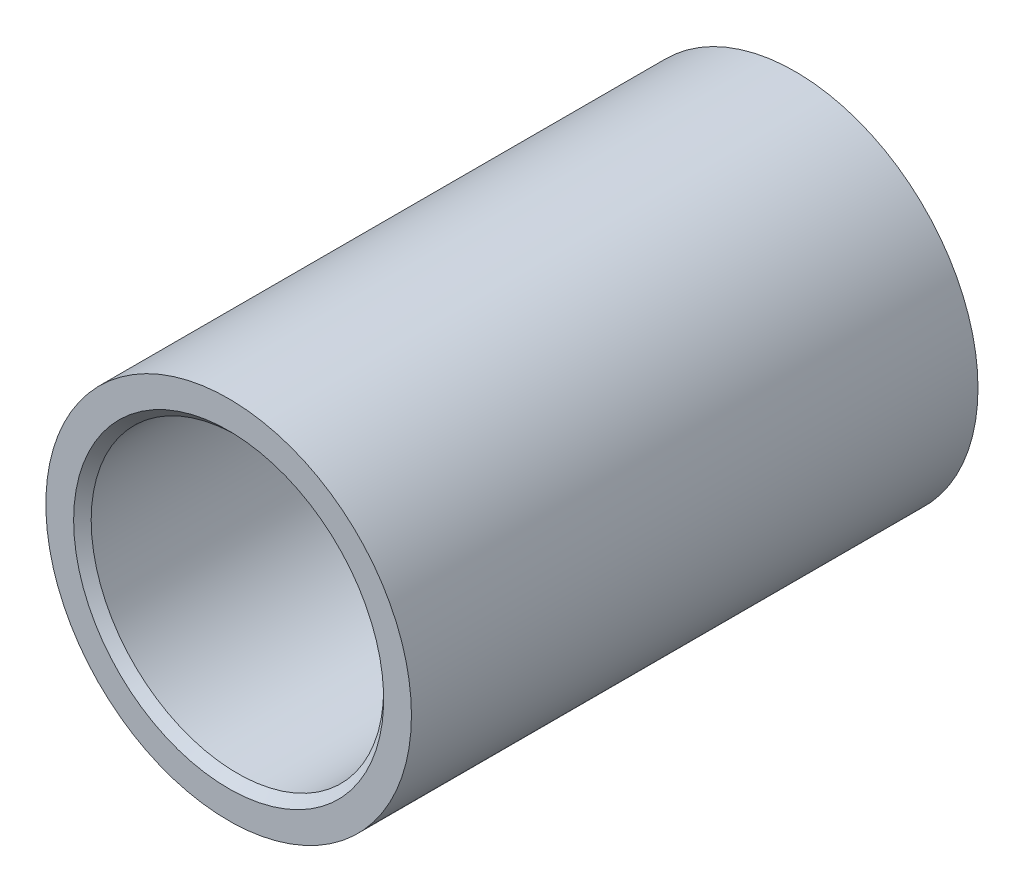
ISO-10303-21;
HEADER;
FILE_DESCRIPTION(('STEP AP214'),'2;1');
FILE_NAME('part.step','',(''),(''),'','','');
FILE_SCHEMA(('AUTOMOTIVE_DESIGN { 1 0 10303 214 1 1 1 1 }'));
ENDSEC;
DATA;
#1=APPLICATION_CONTEXT('core data for automotive mechanical design processes');
#2=APPLICATION_PROTOCOL_DEFINITION('international standard','automotive_design',2000,#1);
#3=PRODUCT_CONTEXT('',#1,'mechanical');
#4=PRODUCT('Part','Part','',(#3));
#5=PRODUCT_RELATED_PRODUCT_CATEGORY('part','',(#4));
#6=PRODUCT_DEFINITION_FORMATION('','',#4);
#7=PRODUCT_DEFINITION_CONTEXT('part definition',#1,'design');
#8=PRODUCT_DEFINITION('design','',#6,#7);
#9=PRODUCT_DEFINITION_SHAPE('','',#8);
#10=(LENGTH_UNIT() NAMED_UNIT(*) SI_UNIT(.MILLI.,.METRE.));
#11=(NAMED_UNIT(*) PLANE_ANGLE_UNIT() SI_UNIT($,.RADIAN.));
#12=(NAMED_UNIT(*) SI_UNIT($,.STERADIAN.) SOLID_ANGLE_UNIT());
#13=UNCERTAINTY_MEASURE_WITH_UNIT(LENGTH_MEASURE(1.E-05),#10,'distance_accuracy_value','');
#14=(GEOMETRIC_REPRESENTATION_CONTEXT(3) GLOBAL_UNCERTAINTY_ASSIGNED_CONTEXT((#13)) GLOBAL_UNIT_ASSIGNED_CONTEXT((#10,
#11,#12)) REPRESENTATION_CONTEXT('',''));
#15=CARTESIAN_POINT('',(0.,0.,0.));
#16=DIRECTION('',(0.,0.,1.));
#17=DIRECTION('',(1.,0.,0.));
#18=AXIS2_PLACEMENT_3D('',#15,#16,#17);
#19=CARTESIAN_POINT('',(0.,0.,31.775));
#20=DIRECTION('',(0.,0.,1.));
#21=DIRECTION('',(1.,0.,0.));
#22=AXIS2_PLACEMENT_3D('',#19,#20,#21);
#23=CYLINDRICAL_SURFACE('',#22,31.75635);
#24=CARTESIAN_POINT('',(0.,0.,0.));
#25=DIRECTION('',(0.,0.,1.));
#26=DIRECTION('',(1.,0.,0.));
#27=AXIS2_PLACEMENT_3D('',#24,#25,#26);
#28=CIRCLE('',#27,31.75635);
#29=CARTESIAN_POINT('',(31.75635,0.,0.));
#30=VERTEX_POINT('',#29);
#31=EDGE_CURVE('E32',#30,#30,#28,.T.);
#32=ORIENTED_EDGE('',*,*,#31,.F.);
#33=EDGE_LOOP('',(#32));
#34=FACE_BOUND('',#33,.T.);
#35=CARTESIAN_POINT('',(0.,0.,-98.425));
#36=DIRECTION('',(0.,0.,1.));
#37=DIRECTION('',(1.,0.,0.));
#38=AXIS2_PLACEMENT_3D('',#35,#36,#37);
#39=CIRCLE('',#38,31.75635);
#40=CARTESIAN_POINT('',(31.75635,0.,-98.425));
#41=VERTEX_POINT('',#40);
#42=EDGE_CURVE('E35',#41,#41,#39,.T.);
#43=ORIENTED_EDGE('',*,*,#42,.T.);
#44=EDGE_LOOP('',(#43));
#45=FACE_BOUND('',#44,.T.);
#46=ADVANCED_FACE('F13',(#34,#45),#23,.T.);
#47=CARTESIAN_POINT('',(31.75635,0.,0.));
#48=DIRECTION('',(0.,0.,-1.));
#49=DIRECTION('',(-1.,0.,0.));
#50=AXIS2_PLACEMENT_3D('',#47,#48,#49);
#51=PLANE('',#50);
#52=CARTESIAN_POINT('',(0.,0.,0.));
#53=DIRECTION('',(0.,0.,-1.));
#54=DIRECTION('',(-1.,0.,0.));
#55=AXIS2_PLACEMENT_3D('',#52,#53,#54);
#56=CIRCLE('',#55,26.93035);
#57=CARTESIAN_POINT('',(-26.93035,0.,0.));
#58=VERTEX_POINT('',#57);
#59=EDGE_CURVE('E9',#58,#58,#56,.T.);
#60=ORIENTED_EDGE('',*,*,#59,.T.);
#61=EDGE_LOOP('',(#60));
#62=FACE_BOUND('',#61,.T.);
#63=ORIENTED_EDGE('',*,*,#31,.T.);
#64=EDGE_LOOP('',(#63));
#65=FACE_BOUND('',#64,.T.);
#66=ADVANCED_FACE('F55',(#62,#65),#51,.F.);
#67=CARTESIAN_POINT('',(0.,0.,31.775));
#68=DIRECTION('',(0.,0.,1.));
#69=DIRECTION('',(1.,0.,0.));
#70=AXIS2_PLACEMENT_3D('',#67,#68,#69);
#71=CYLINDRICAL_SURFACE('',#70,25.40635);
#72=CARTESIAN_POINT('',(0.,0.,-96.901));
#73=DIRECTION('',(0.,0.,1.));
#74=DIRECTION('',(1.,0.,0.));
#75=AXIS2_PLACEMENT_3D('',#72,#73,#74);
#76=CIRCLE('',#75,25.40635);
#77=CARTESIAN_POINT('',(25.40635,0.,-96.901));
#78=VERTEX_POINT('',#77);
#79=EDGE_CURVE('E19',#78,#78,#76,.F.);
#80=ORIENTED_EDGE('',*,*,#79,.T.);
#81=EDGE_LOOP('',(#80));
#82=FACE_BOUND('',#81,.T.);
#83=CARTESIAN_POINT('',(0.,0.,-1.524));
#84=DIRECTION('',(0.,0.,-1.));
#85=DIRECTION('',(-1.,0.,0.));
#86=AXIS2_PLACEMENT_3D('',#83,#84,#85);
#87=CIRCLE('',#86,25.40635);
#88=CARTESIAN_POINT('',(-25.40635,0.,-1.524));
#89=VERTEX_POINT('',#88);
#90=EDGE_CURVE('E23',#89,#89,#87,.F.);
#91=ORIENTED_EDGE('',*,*,#90,.T.);
#92=EDGE_LOOP('',(#91));
#93=FACE_BOUND('',#92,.T.);
#94=ADVANCED_FACE('F43',(#82,#93),#71,.F.);
#95=CARTESIAN_POINT('',(25.40635,0.,-98.425));
#96=DIRECTION('',(0.,0.,1.));
#97=DIRECTION('',(1.,0.,0.));
#98=AXIS2_PLACEMENT_3D('',#95,#96,#97);
#99=PLANE('',#98);
#100=CARTESIAN_POINT('',(0.,0.,-98.425));
#101=DIRECTION('',(0.,0.,1.));
#102=DIRECTION('',(1.,0.,0.));
#103=AXIS2_PLACEMENT_3D('',#100,#101,#102);
#104=CIRCLE('',#103,26.93035);
#105=CARTESIAN_POINT('',(26.93035,0.,-98.425));
#106=VERTEX_POINT('',#105);
#107=EDGE_CURVE('E27',#106,#106,#104,.T.);
#108=ORIENTED_EDGE('',*,*,#107,.T.);
#109=EDGE_LOOP('',(#108));
#110=FACE_BOUND('',#109,.T.);
#111=ORIENTED_EDGE('',*,*,#42,.F.);
#112=EDGE_LOOP('',(#111));
#113=FACE_BOUND('',#112,.T.);
#114=ADVANCED_FACE('F40',(#110,#113),#99,.F.);
#115=CARTESIAN_POINT('',(0.,0.,-98.425));
#116=DIRECTION('',(0.,0.,-1.));
#117=DIRECTION('',(-1.,0.,0.));
#118=AXIS2_PLACEMENT_3D('',#115,#116,#117);
#119=CONICAL_SURFACE('',#118,26.93035,0.785398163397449);
#120=ORIENTED_EDGE('',*,*,#79,.F.);
#121=EDGE_LOOP('',(#120));
#122=FACE_BOUND('',#121,.T.);
#123=ORIENTED_EDGE('',*,*,#107,.F.);
#124=EDGE_LOOP('',(#123));
#125=FACE_BOUND('',#124,.T.);
#126=ADVANCED_FACE('F42',(#122,#125),#119,.F.);
#127=CARTESIAN_POINT('',(0.,0.,-1.524));
#128=DIRECTION('',(0.,0.,1.));
#129=DIRECTION('',(1.,0.,0.));
#130=AXIS2_PLACEMENT_3D('',#127,#128,#129);
#131=CONICAL_SURFACE('',#130,25.40635,0.785398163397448);
#132=ORIENTED_EDGE('',*,*,#59,.F.);
#133=EDGE_LOOP('',(#132));
#134=FACE_BOUND('',#133,.T.);
#135=ORIENTED_EDGE('',*,*,#90,.F.);
#136=EDGE_LOOP('',(#135));
#137=FACE_BOUND('',#136,.T.);
#138=ADVANCED_FACE('F52',(#134,#137),#131,.F.);
#139=CLOSED_SHELL('',(#46,#66,#94,#114,#126,#138));
#140=MANIFOLD_SOLID_BREP('B1',#139);
#141=ADVANCED_BREP_SHAPE_REPRESENTATION('',(#18,#140),#14);
#142=SHAPE_DEFINITION_REPRESENTATION(#9,#141);
ENDSEC;
END-ISO-10303-21;
